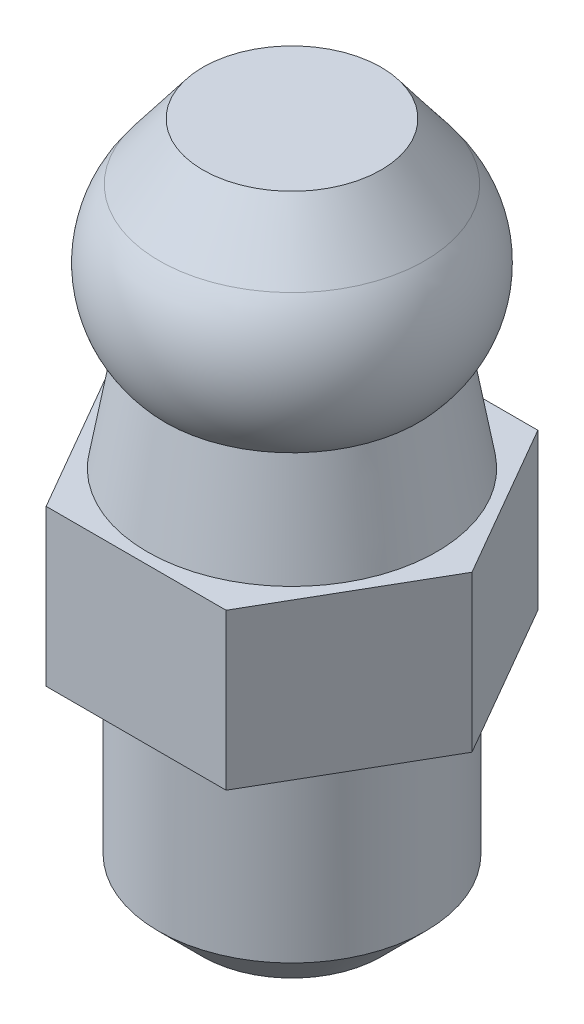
ISO-10303-21;
HEADER;
FILE_DESCRIPTION(('STEP AP214'),'2;1');
FILE_NAME('part.step','',(''),(''),'','','');
FILE_SCHEMA(('AUTOMOTIVE_DESIGN { 1 0 10303 214 1 1 1 1 }'));
ENDSEC;
DATA;
#1=APPLICATION_CONTEXT('core data for automotive mechanical design processes');
#2=APPLICATION_PROTOCOL_DEFINITION('international standard','automotive_design',2000,#1);
#3=PRODUCT_CONTEXT('',#1,'mechanical');
#4=PRODUCT('Part','Part','',(#3));
#5=PRODUCT_RELATED_PRODUCT_CATEGORY('part','',(#4));
#6=PRODUCT_DEFINITION_FORMATION('','',#4);
#7=PRODUCT_DEFINITION_CONTEXT('part definition',#1,'design');
#8=PRODUCT_DEFINITION('design','',#6,#7);
#9=PRODUCT_DEFINITION_SHAPE('','',#8);
#10=(LENGTH_UNIT() NAMED_UNIT(*) SI_UNIT(.MILLI.,.METRE.));
#11=(NAMED_UNIT(*) PLANE_ANGLE_UNIT() SI_UNIT($,.RADIAN.));
#12=(NAMED_UNIT(*) SI_UNIT($,.STERADIAN.) SOLID_ANGLE_UNIT());
#13=UNCERTAINTY_MEASURE_WITH_UNIT(LENGTH_MEASURE(1.E-05),#10,'distance_accuracy_value','');
#14=(GEOMETRIC_REPRESENTATION_CONTEXT(3) GLOBAL_UNCERTAINTY_ASSIGNED_CONTEXT((#13)) GLOBAL_UNIT_ASSIGNED_CONTEXT((#10,
#11,#12)) REPRESENTATION_CONTEXT('',''));
#15=CARTESIAN_POINT('',(0.,0.,0.));
#16=DIRECTION('',(0.,0.,1.));
#17=DIRECTION('',(1.,0.,0.));
#18=AXIS2_PLACEMENT_3D('',#15,#16,#17);
#19=CARTESIAN_POINT('',(-2.,15.3,0.));
#20=DIRECTION('',(0.,-1.,0.));
#21=DIRECTION('',(0.,0.,-1.));
#22=AXIS2_PLACEMENT_3D('',#19,#20,#21);
#23=PLANE('',#22);
#24=CARTESIAN_POINT('',(0.,15.3000000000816,0.));
#25=DIRECTION('',(0.,-1.,0.));
#26=DIRECTION('',(0.,0.,-1.));
#27=AXIS2_PLACEMENT_3D('',#24,#25,#26);
#28=CIRCLE('',#27,2.00000000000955);
#29=CARTESIAN_POINT('',(0.,15.3000000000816,-2.00000000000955));
#30=VERTEX_POINT('',#29);
#31=EDGE_CURVE('E19',#30,#30,#28,.T.);
#32=ORIENTED_EDGE('',*,*,#31,.F.);
#33=EDGE_LOOP('',(#32));
#34=FACE_BOUND('',#33,.T.);
#35=ADVANCED_FACE('F16',(#34),#23,.F.);
#36=CARTESIAN_POINT('',(0.,14.0245057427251,0.));
#37=DIRECTION('',(0.,-1.,0.));
#38=DIRECTION('',(0.,0.,-1.));
#39=AXIS2_PLACEMENT_3D('',#36,#37,#38);
#40=CONICAL_SURFACE('',#39,2.9813839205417,0.655811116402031);
#41=CARTESIAN_POINT('',(0.,14.0245057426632,0.));
#42=DIRECTION('',(0.,-1.,0.));
#43=DIRECTION('',(0.,0.,-1.));
#44=AXIS2_PLACEMENT_3D('',#41,#42,#43);
#45=CIRCLE('',#44,2.98138392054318);
#46=CARTESIAN_POINT('',(0.,14.0245057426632,-2.98138392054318));
#47=VERTEX_POINT('',#46);
#48=EDGE_CURVE('E99',#47,#47,#45,.T.);
#49=ORIENTED_EDGE('',*,*,#48,.F.);
#50=EDGE_LOOP('',(#49));
#51=FACE_BOUND('',#50,.T.);
#52=ORIENTED_EDGE('',*,*,#31,.T.);
#53=EDGE_LOOP('',(#52));
#54=FACE_BOUND('',#53,.T.);
#55=ADVANCED_FACE('F108',(#51,#54),#40,.T.);
#56=CARTESIAN_POINT('',(0.,12.5,-1.));
#57=DIRECTION('',(1.,0.,0.));
#58=DIRECTION('',(0.,0.,-1.));
#59=AXIS2_PLACEMENT_3D('',#56,#57,#58);
#60=CIRCLE('',#59,2.5);
#61=TRIMMED_CURVE('',#60,(PARAMETER_VALUE(-1.98231317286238)),
(PARAMETER_VALUE(1.98231317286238)),.T.,.PARAMETER.);
#62=CARTESIAN_POINT('',(0.,12.5,0.));
#63=DIRECTION('',(0.,-1.,0.));
#64=AXIS1_PLACEMENT('',#62,#63);
#65=SURFACE_OF_REVOLUTION('',#61,#64);
#66=CARTESIAN_POINT('',(0.,10.8103938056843,0.));
#67=DIRECTION('',(0.,-1.,0.));
#68=DIRECTION('',(0.,0.,-1.));
#69=AXIS2_PLACEMENT_3D('',#66,#67,#68);
#70=CIRCLE('',#69,2.84261523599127);
#71=CARTESIAN_POINT('',(0.,10.8103938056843,-2.84261523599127));
#72=VERTEX_POINT('',#71);
#73=EDGE_CURVE('E96',#72,#72,#70,.T.);
#74=ORIENTED_EDGE('',*,*,#73,.F.);
#75=EDGE_LOOP('',(#74));
#76=FACE_BOUND('',#75,.T.);
#77=ORIENTED_EDGE('',*,*,#48,.T.);
#78=EDGE_LOOP('',(#77));
#79=FACE_BOUND('',#78,.T.);
#80=ADVANCED_FACE('F104',(#76,#79),#65,.F.);
#81=CARTESIAN_POINT('',(0.,8.49999999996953,0.));
#82=DIRECTION('',(0.,-1.,0.));
#83=DIRECTION('',(0.,0.,-1.));
#84=AXIS2_PLACEMENT_3D('',#81,#82,#83);
#85=CONICAL_SURFACE('',#84,3.2499999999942,0.174532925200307);
#86=CARTESIAN_POINT('',(0.,8.49999999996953,0.));
#87=DIRECTION('',(0.,-1.,0.));
#88=DIRECTION('',(0.,0.,-1.));
#89=AXIS2_PLACEMENT_3D('',#86,#87,#88);
#90=CIRCLE('',#89,3.2499999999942);
#91=CARTESIAN_POINT('',(0.,8.49999999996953,-3.2499999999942));
#92=VERTEX_POINT('',#91);
#93=EDGE_CURVE('E78',#92,#92,#90,.F.);
#94=ORIENTED_EDGE('',*,*,#93,.T.);
#95=EDGE_LOOP('',(#94));
#96=FACE_BOUND('',#95,.T.);
#97=ORIENTED_EDGE('',*,*,#73,.T.);
#98=EDGE_LOOP('',(#97));
#99=FACE_BOUND('',#98,.T.);
#100=ADVANCED_FACE('F107',(#96,#99),#85,.T.);
#101=CARTESIAN_POINT('',(-4.5,8.5,0.));
#102=DIRECTION('',(0.,-1.,0.));
#103=DIRECTION('',(0.,0.,-1.));
#104=AXIS2_PLACEMENT_3D('',#101,#102,#103);
#105=PLANE('',#104);
#106=DIRECTION('',(-1.,0.,0.));
#107=VECTOR('',#106,1.);
#108=CARTESIAN_POINT('',(-2.02072594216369,8.5,-3.5));
#109=LINE('',#108,#107);
#110=CARTESIAN_POINT('',(-2.02072594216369,8.5,-3.5));
#111=VERTEX_POINT('',#110);
#112=CARTESIAN_POINT('',(2.02072594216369,8.5,-3.5));
#113=VERTEX_POINT('',#112);
#114=EDGE_CURVE('E70',#111,#113,#109,.F.);
#115=ORIENTED_EDGE('',*,*,#114,.F.);
#116=DIRECTION('',(-0.5,0.,0.866025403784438));
#117=VECTOR('',#116,1.);
#118=CARTESIAN_POINT('',(-4.04145188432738,8.5,0.));
#119=LINE('',#118,#117);
#120=CARTESIAN_POINT('',(-4.04145188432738,8.5,0.));
#121=VERTEX_POINT('',#120);
#122=EDGE_CURVE('E67',#121,#111,#119,.F.);
#123=ORIENTED_EDGE('',*,*,#122,.F.);
#124=DIRECTION('',(0.5,0.,0.866025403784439));
#125=VECTOR('',#124,1.);
#126=CARTESIAN_POINT('',(-2.02072594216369,8.5,3.5));
#127=LINE('',#126,#125);
#128=CARTESIAN_POINT('',(-2.02072594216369,8.5,3.5));
#129=VERTEX_POINT('',#128);
#130=EDGE_CURVE('E87',#129,#121,#127,.F.);
#131=ORIENTED_EDGE('',*,*,#130,.F.);
#132=DIRECTION('',(1.,0.,0.));
#133=VECTOR('',#132,1.);
#134=CARTESIAN_POINT('',(2.02072594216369,8.5,3.5));
#135=LINE('',#134,#133);
#136=CARTESIAN_POINT('',(2.02072594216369,8.5,3.5));
#137=VERTEX_POINT('',#136);
#138=EDGE_CURVE('E208',#137,#129,#135,.F.);
#139=ORIENTED_EDGE('',*,*,#138,.F.);
#140=DIRECTION('',(0.5,0.,-0.866025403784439));
#141=VECTOR('',#140,1.);
#142=CARTESIAN_POINT('',(4.04145188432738,8.5,0.));
#143=LINE('',#142,#141);
#144=CARTESIAN_POINT('',(4.04145188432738,8.5,0.));
#145=VERTEX_POINT('',#144);
#146=EDGE_CURVE('E202',#145,#137,#143,.F.);
#147=ORIENTED_EDGE('',*,*,#146,.F.);
#148=DIRECTION('',(-0.5,0.,-0.866025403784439));
#149=VECTOR('',#148,1.);
#150=CARTESIAN_POINT('',(2.02072594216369,8.5,-3.5));
#151=LINE('',#150,#149);
#152=EDGE_CURVE('E75',#113,#145,#151,.F.);
#153=ORIENTED_EDGE('',*,*,#152,.F.);
#154=EDGE_LOOP('',(#115,#123,#131,#139,#147,#153));
#155=FACE_BOUND('',#154,.T.);
#156=ORIENTED_EDGE('',*,*,#93,.F.);
#157=EDGE_LOOP('',(#156));
#158=FACE_BOUND('',#157,.T.);
#159=ADVANCED_FACE('F72',(#155,#158),#105,.F.);
#160=CARTESIAN_POINT('',(-2.02072594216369,15.3,-3.5));
#161=DIRECTION('',(0.,0.,-1.));
#162=DIRECTION('',(-1.,0.,0.));
#163=AXIS2_PLACEMENT_3D('',#160,#161,#162);
#164=PLANE('',#163);
#165=DIRECTION('',(1.,0.,0.));
#166=VECTOR('',#165,1.);
#167=CARTESIAN_POINT('',(-3.,5.,-3.5));
#168=LINE('',#167,#166);
#169=CARTESIAN_POINT('',(2.02072594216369,5.,-3.5));
#170=VERTEX_POINT('',#169);
#171=CARTESIAN_POINT('',(-2.02072594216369,5.,-3.5));
#172=VERTEX_POINT('',#171);
#173=EDGE_CURVE('E84',#170,#172,#168,.F.);
#174=ORIENTED_EDGE('',*,*,#173,.T.);
#175=DIRECTION('',(0.,1.,0.));
#176=VECTOR('',#175,1.);
#177=CARTESIAN_POINT('',(-2.02072594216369,15.3,-3.5));
#178=LINE('',#177,#176);
#179=EDGE_CURVE('E81',#111,#172,#178,.F.);
#180=ORIENTED_EDGE('',*,*,#179,.F.);
#181=ORIENTED_EDGE('',*,*,#114,.T.);
#182=DIRECTION('',(0.,1.,0.));
#183=VECTOR('',#182,1.);
#184=CARTESIAN_POINT('',(2.02072594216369,15.3,-3.5));
#185=LINE('',#184,#183);
#186=EDGE_CURVE('E195',#170,#113,#185,.T.);
#187=ORIENTED_EDGE('',*,*,#186,.F.);
#188=EDGE_LOOP('',(#174,#180,#181,#187));
#189=FACE_BOUND('',#188,.T.);
#190=ADVANCED_FACE('F82',(#189),#164,.T.);
#191=CARTESIAN_POINT('',(-4.04145188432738,15.3,0.));
#192=DIRECTION('',(-0.866025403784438,0.,-0.5));
#193=DIRECTION('',(-0.5,0.,0.866025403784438));
#194=AXIS2_PLACEMENT_3D('',#191,#192,#193);
#195=PLANE('',#194);
#196=DIRECTION('',(-0.5,0.,0.866025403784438));
#197=VECTOR('',#196,1.);
#198=CARTESIAN_POINT('',(-2.02072594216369,5.,-3.5));
#199=LINE('',#198,#197);
#200=CARTESIAN_POINT('',(-4.04145188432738,5.,0.));
#201=VERTEX_POINT('',#200);
#202=EDGE_CURVE('E192',#172,#201,#199,.T.);
#203=ORIENTED_EDGE('',*,*,#202,.T.);
#204=DIRECTION('',(0.,1.,0.));
#205=VECTOR('',#204,1.);
#206=CARTESIAN_POINT('',(-4.04145188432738,15.3,0.));
#207=LINE('',#206,#205);
#208=EDGE_CURVE('E91',#121,#201,#207,.F.);
#209=ORIENTED_EDGE('',*,*,#208,.F.);
#210=ORIENTED_EDGE('',*,*,#122,.T.);
#211=ORIENTED_EDGE('',*,*,#179,.T.);
#212=EDGE_LOOP('',(#203,#209,#210,#211));
#213=FACE_BOUND('',#212,.T.);
#214=ADVANCED_FACE('F89',(#213),#195,.T.);
#215=CARTESIAN_POINT('',(-2.02072594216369,15.3,3.5));
#216=DIRECTION('',(-0.866025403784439,0.,0.5));
#217=DIRECTION('',(0.5,0.,0.866025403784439));
#218=AXIS2_PLACEMENT_3D('',#215,#216,#217);
#219=PLANE('',#218);
#220=DIRECTION('',(0.5,0.,0.866025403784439));
#221=VECTOR('',#220,1.);
#222=CARTESIAN_POINT('',(-4.04145188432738,5.,0.));
#223=LINE('',#222,#221);
#224=CARTESIAN_POINT('',(-2.02072594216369,5.,3.5));
#225=VERTEX_POINT('',#224);
#226=EDGE_CURVE('E190',#201,#225,#223,.T.);
#227=ORIENTED_EDGE('',*,*,#226,.T.);
#228=DIRECTION('',(0.,1.,0.));
#229=VECTOR('',#228,1.);
#230=CARTESIAN_POINT('',(-2.02072594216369,15.3,3.5));
#231=LINE('',#230,#229);
#232=EDGE_CURVE('E205',#129,#225,#231,.F.);
#233=ORIENTED_EDGE('',*,*,#232,.F.);
#234=ORIENTED_EDGE('',*,*,#130,.T.);
#235=ORIENTED_EDGE('',*,*,#208,.T.);
#236=EDGE_LOOP('',(#227,#233,#234,#235));
#237=FACE_BOUND('',#236,.T.);
#238=ADVANCED_FACE('F151',(#237),#219,.T.);
#239=CARTESIAN_POINT('',(2.02072594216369,15.3,3.5));
#240=DIRECTION('',(0.,0.,1.));
#241=DIRECTION('',(1.,0.,0.));
#242=AXIS2_PLACEMENT_3D('',#239,#240,#241);
#243=PLANE('',#242);
#244=DIRECTION('',(1.,0.,0.));
#245=VECTOR('',#244,1.);
#246=CARTESIAN_POINT('',(-3.,5.,3.5));
#247=LINE('',#246,#245);
#248=CARTESIAN_POINT('',(2.02072594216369,5.,3.5));
#249=VERTEX_POINT('',#248);
#250=EDGE_CURVE('E186',#225,#249,#247,.T.);
#251=ORIENTED_EDGE('',*,*,#250,.T.);
#252=DIRECTION('',(0.,1.,0.));
#253=VECTOR('',#252,1.);
#254=CARTESIAN_POINT('',(2.02072594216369,15.3,3.5));
#255=LINE('',#254,#253);
#256=EDGE_CURVE('E200',#137,#249,#255,.F.);
#257=ORIENTED_EDGE('',*,*,#256,.F.);
#258=ORIENTED_EDGE('',*,*,#138,.T.);
#259=ORIENTED_EDGE('',*,*,#232,.T.);
#260=EDGE_LOOP('',(#251,#257,#258,#259));
#261=FACE_BOUND('',#260,.T.);
#262=ADVANCED_FACE('F148',(#261),#243,.T.);
#263=CARTESIAN_POINT('',(4.04145188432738,15.3,0.));
#264=DIRECTION('',(0.866025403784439,0.,0.5));
#265=DIRECTION('',(0.5,0.,-0.866025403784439));
#266=AXIS2_PLACEMENT_3D('',#263,#264,#265);
#267=PLANE('',#266);
#268=DIRECTION('',(0.5,0.,-0.866025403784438));
#269=VECTOR('',#268,1.);
#270=CARTESIAN_POINT('',(2.02072594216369,5.,3.5));
#271=LINE('',#270,#269);
#272=CARTESIAN_POINT('',(4.04145188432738,5.,0.));
#273=VERTEX_POINT('',#272);
#274=EDGE_CURVE('E34',#249,#273,#271,.T.);
#275=ORIENTED_EDGE('',*,*,#274,.T.);
#276=DIRECTION('',(0.,1.,0.));
#277=VECTOR('',#276,1.);
#278=CARTESIAN_POINT('',(4.04145188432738,15.3,0.));
#279=LINE('',#278,#277);
#280=EDGE_CURVE('E197',#145,#273,#279,.F.);
#281=ORIENTED_EDGE('',*,*,#280,.F.);
#282=ORIENTED_EDGE('',*,*,#146,.T.);
#283=ORIENTED_EDGE('',*,*,#256,.T.);
#284=EDGE_LOOP('',(#275,#281,#282,#283));
#285=FACE_BOUND('',#284,.T.);
#286=ADVANCED_FACE('F144',(#285),#267,.T.);
#287=CARTESIAN_POINT('',(2.02072594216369,15.3,-3.5));
#288=DIRECTION('',(0.866025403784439,0.,-0.5));
#289=DIRECTION('',(-0.5,0.,-0.866025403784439));
#290=AXIS2_PLACEMENT_3D('',#287,#288,#289);
#291=PLANE('',#290);
#292=DIRECTION('',(-0.5,0.,-0.866025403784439));
#293=VECTOR('',#292,1.);
#294=CARTESIAN_POINT('',(4.04145188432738,5.,0.));
#295=LINE('',#294,#293);
#296=EDGE_CURVE('E177',#273,#170,#295,.T.);
#297=ORIENTED_EDGE('',*,*,#296,.T.);
#298=ORIENTED_EDGE('',*,*,#186,.T.);
#299=ORIENTED_EDGE('',*,*,#152,.T.);
#300=ORIENTED_EDGE('',*,*,#280,.T.);
#301=EDGE_LOOP('',(#297,#298,#299,#300));
#302=FACE_BOUND('',#301,.T.);
#303=ADVANCED_FACE('F140',(#302),#291,.T.);
#304=CARTESIAN_POINT('',(0.,0.,0.));
#305=DIRECTION('',(0.,1.,0.));
#306=DIRECTION('',(0.,0.,1.));
#307=AXIS2_PLACEMENT_3D('',#304,#305,#306);
#308=PLANE('',#307);
#309=CARTESIAN_POINT('',(0.,0.,0.));
#310=DIRECTION('',(0.,1.,0.));
#311=DIRECTION('',(0.,0.,1.));
#312=AXIS2_PLACEMENT_3D('',#309,#310,#311);
#313=CIRCLE('',#312,2.00000000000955);
#314=CARTESIAN_POINT('',(0.,0.,2.00000000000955));
#315=VERTEX_POINT('',#314);
#316=EDGE_CURVE('E175',#315,#315,#313,.T.);
#317=ORIENTED_EDGE('',*,*,#316,.F.);
#318=EDGE_LOOP('',(#317));
#319=FACE_BOUND('',#318,.T.);
#320=ADVANCED_FACE('F136',(#319),#308,.F.);
#321=CARTESIAN_POINT('',(-3.,5.,0.));
#322=DIRECTION('',(0.,1.,0.));
#323=DIRECTION('',(0.,0.,1.));
#324=AXIS2_PLACEMENT_3D('',#321,#322,#323);
#325=PLANE('',#324);
#326=ORIENTED_EDGE('',*,*,#274,.F.);
#327=ORIENTED_EDGE('',*,*,#250,.F.);
#328=ORIENTED_EDGE('',*,*,#226,.F.);
#329=ORIENTED_EDGE('',*,*,#202,.F.);
#330=ORIENTED_EDGE('',*,*,#173,.F.);
#331=ORIENTED_EDGE('',*,*,#296,.F.);
#332=EDGE_LOOP('',(#326,#327,#328,#329,#330,#331));
#333=FACE_BOUND('',#332,.T.);
#334=CARTESIAN_POINT('',(0.,5.,0.));
#335=DIRECTION('',(0.,-1.,0.));
#336=DIRECTION('',(0.,0.,-1.));
#337=AXIS2_PLACEMENT_3D('',#334,#335,#336);
#338=CIRCLE('',#337,3.);
#339=CARTESIAN_POINT('',(0.,5.,-3.));
#340=VERTEX_POINT('',#339);
#341=EDGE_CURVE('E25',#340,#340,#338,.T.);
#342=ORIENTED_EDGE('',*,*,#341,.F.);
#343=EDGE_LOOP('',(#342));
#344=FACE_BOUND('',#343,.T.);
#345=ADVANCED_FACE('F129',(#333,#344),#325,.F.);
#346=CARTESIAN_POINT('',(0.,1.0000000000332,0.));
#347=DIRECTION('',(0.,1.,0.));
#348=DIRECTION('',(0.,0.,1.));
#349=AXIS2_PLACEMENT_3D('',#346,#347,#348);
#350=CONICAL_SURFACE('',#349,3.00000000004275,0.785398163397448);
#351=CARTESIAN_POINT('',(0.,1.,0.));
#352=DIRECTION('',(0.,-1.,0.));
#353=DIRECTION('',(0.,0.,-1.));
#354=AXIS2_PLACEMENT_3D('',#351,#352,#353);
#355=CIRCLE('',#354,3.);
#356=CARTESIAN_POINT('',(0.,1.,-3.));
#357=VERTEX_POINT('',#356);
#358=EDGE_CURVE('E11',#357,#357,#355,.F.);
#359=ORIENTED_EDGE('',*,*,#358,.F.);
#360=EDGE_LOOP('',(#359));
#361=FACE_BOUND('',#360,.T.);
#362=ORIENTED_EDGE('',*,*,#316,.T.);
#363=EDGE_LOOP('',(#362));
#364=FACE_BOUND('',#363,.T.);
#365=ADVANCED_FACE('F123',(#361,#364),#350,.T.);
#366=CARTESIAN_POINT('',(0.,0.,0.));
#367=DIRECTION('',(0.,-1.,0.));
#368=DIRECTION('',(0.,0.,-1.));
#369=AXIS2_PLACEMENT_3D('',#366,#367,#368);
#370=CYLINDRICAL_SURFACE('',#369,3.);
#371=ORIENTED_EDGE('',*,*,#358,.T.);
#372=EDGE_LOOP('',(#371));
#373=FACE_BOUND('',#372,.T.);
#374=ORIENTED_EDGE('',*,*,#341,.T.);
#375=EDGE_LOOP('',(#374));
#376=FACE_BOUND('',#375,.T.);
#377=ADVANCED_FACE('F121',(#373,#376),#370,.T.);
#378=CLOSED_SHELL('',(#35,#55,#80,#100,#159,#190,#214,#238,#262,#286,#303,#320,#345,#365,#377));
#379=MANIFOLD_SOLID_BREP('B1',#378);
#380=ADVANCED_BREP_SHAPE_REPRESENTATION('',(#18,#379),#14);
#381=SHAPE_DEFINITION_REPRESENTATION(#9,#380);
ENDSEC;
END-ISO-10303-21;
